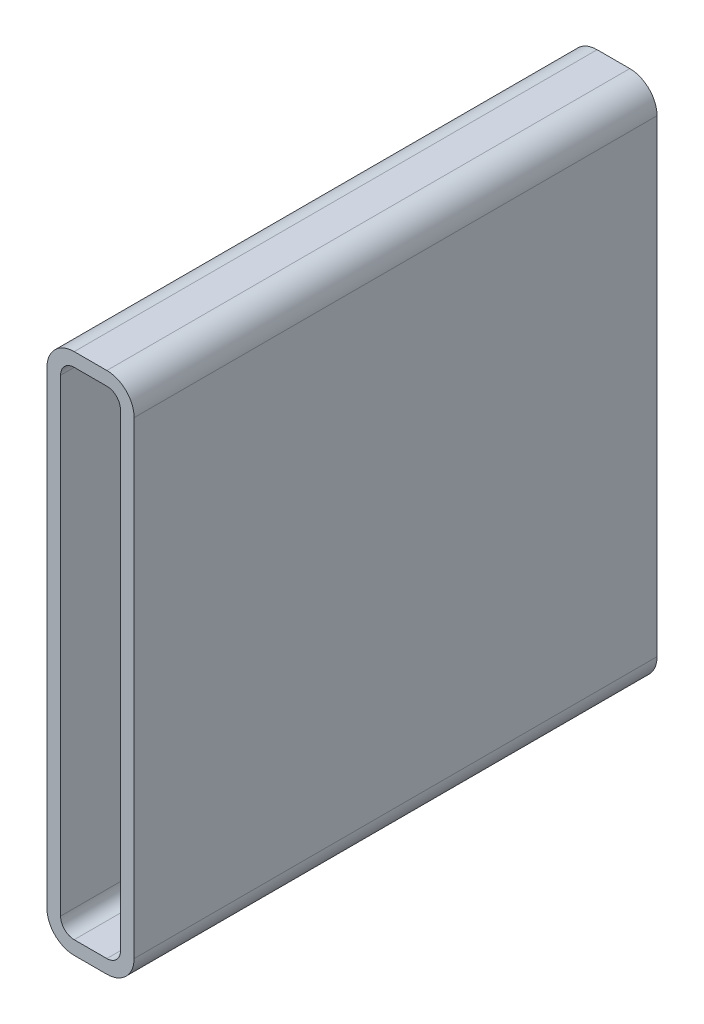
from build123d import *

# Parameters (mm, degrees)
BOSS_EXTRUDE1_DEPTH = 304.8


with BuildPart() as part:
    # Sketch1 → Boss-Extrude1 (new body)
    with BuildSketch(Plane.XY):
        with BuildLine():
            Line((15.875, 304.8), (34.925, 304.8))
            ThreePointArc((34.925, 304.8), (46.150320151, 300.150320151), (50.8, 288.925))
            Line((50.8, 288.925), (50.8, 15.875))
            ThreePointArc((50.8, 15.875), (46.150320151, 4.649679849), (34.925, 0))
            Line((34.925, 0), (15.875, 0))
            ThreePointArc((15.875, 0), (4.649679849, 4.649679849), (0, 15.875))
            Line((0, 15.875), (0, 288.925))
            ThreePointArc((0, 288.925), (4.649679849, 300.150320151), (15.875, 304.8))
        make_face()
        with BuildLine():
            Line((15.875, 296.8625), (34.925, 296.8625))
            ThreePointArc((34.925, 296.8625), (40.537660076, 294.537660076), (42.8625, 288.925))
            Line((42.8625, 288.925), (42.8625, 15.875))
            ThreePointArc((42.8625, 15.875), (40.537660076, 10.262339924), (34.925, 7.9375))
            Line((34.925, 7.9375), (15.875, 7.9375))
            ThreePointArc((15.875, 7.9375), (10.262339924, 10.262339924), (7.9375, 15.875))
            Line((7.9375, 15.875), (7.9375, 288.925))
            ThreePointArc((7.9375, 288.925), (10.262339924, 294.537660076), (15.875, 296.8625))
        make_face(mode=Mode.SUBTRACT)
    extrude(amount=BOSS_EXTRUDE1_DEPTH)


solid = part.part
